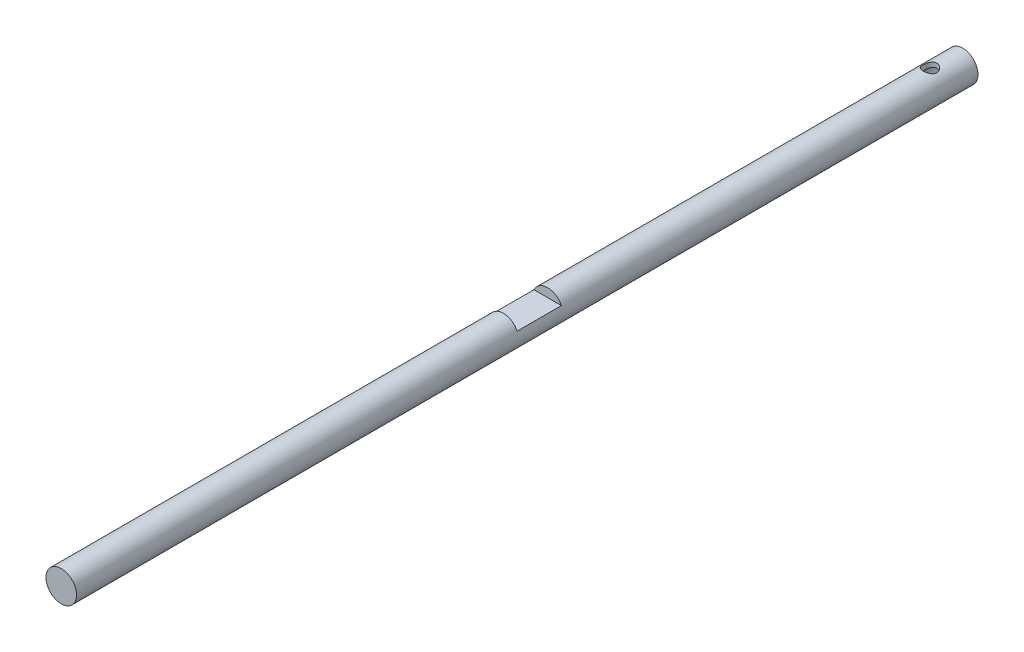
ISO-10303-21;
HEADER;
FILE_DESCRIPTION(('STEP AP214'),'2;1');
FILE_NAME('part.step','',(''),(''),'','','');
FILE_SCHEMA(('AUTOMOTIVE_DESIGN { 1 0 10303 214 1 1 1 1 }'));
ENDSEC;
DATA;
#1=APPLICATION_CONTEXT('core data for automotive mechanical design processes');
#2=APPLICATION_PROTOCOL_DEFINITION('international standard','automotive_design',2000,#1);
#3=PRODUCT_CONTEXT('',#1,'mechanical');
#4=PRODUCT('Part','Part','',(#3));
#5=PRODUCT_RELATED_PRODUCT_CATEGORY('part','',(#4));
#6=PRODUCT_DEFINITION_FORMATION('','',#4);
#7=PRODUCT_DEFINITION_CONTEXT('part definition',#1,'design');
#8=PRODUCT_DEFINITION('design','',#6,#7);
#9=PRODUCT_DEFINITION_SHAPE('','',#8);
#10=(LENGTH_UNIT() NAMED_UNIT(*) SI_UNIT(.MILLI.,.METRE.));
#11=(NAMED_UNIT(*) PLANE_ANGLE_UNIT() SI_UNIT($,.RADIAN.));
#12=(NAMED_UNIT(*) SI_UNIT($,.STERADIAN.) SOLID_ANGLE_UNIT());
#13=UNCERTAINTY_MEASURE_WITH_UNIT(LENGTH_MEASURE(1.E-05),#10,'distance_accuracy_value','');
#14=(GEOMETRIC_REPRESENTATION_CONTEXT(3) GLOBAL_UNCERTAINTY_ASSIGNED_CONTEXT((#13)) GLOBAL_UNIT_ASSIGNED_CONTEXT((#10,
#11,#12)) REPRESENTATION_CONTEXT('',''));
#15=CARTESIAN_POINT('',(0.,0.,0.));
#16=DIRECTION('',(0.,0.,1.));
#17=DIRECTION('',(1.,0.,0.));
#18=AXIS2_PLACEMENT_3D('',#15,#16,#17);
#19=CARTESIAN_POINT('',(0.,0.,-274.6213585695));
#20=DIRECTION('',(0.,0.,1.));
#21=DIRECTION('',(1.,0.,0.));
#22=AXIS2_PLACEMENT_3D('',#19,#20,#21);
#23=CYLINDRICAL_SURFACE('',#22,4.445);
#24=CARTESIAN_POINT('',(-1.29240188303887E-11,4.445,-250.524));
#25=CARTESIAN_POINT('',(0.106363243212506,4.44499571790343,-250.524005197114));
#26=CARTESIAN_POINT('',(0.212889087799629,4.44113977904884,-250.532534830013));
#27=CARTESIAN_POINT('',(0.422868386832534,4.42609838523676,-250.566311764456));
#28=CARTESIAN_POINT('',(0.526313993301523,4.41489564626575,-250.591598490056));
#29=CARTESIAN_POINT('',(0.726763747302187,4.38634837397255,-250.657744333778));
#30=CARTESIAN_POINT('',(0.823789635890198,4.36902597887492,-250.698547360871));
#31=CARTESIAN_POINT('',(1.00950916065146,4.32988863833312,-250.794313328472));
#32=CARTESIAN_POINT('',(1.09820456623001,4.30807465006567,-250.849273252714));
#33=CARTESIAN_POINT('',(1.26991974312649,4.2607121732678,-250.975061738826));
#34=CARTESIAN_POINT('',(1.35240803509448,4.23502882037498,-251.046564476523));
#35=CARTESIAN_POINT('',(1.50469291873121,4.18334834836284,-251.201975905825));
#36=CARTESIAN_POINT('',(1.57448175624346,4.15735104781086,-251.285892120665));
#37=CARTESIAN_POINT('',(1.70351755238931,4.10623396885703,-251.469781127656));
#38=CARTESIAN_POINT('',(1.76188954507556,4.0812585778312,-251.570412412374));
#39=CARTESIAN_POINT('',(1.86064265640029,4.03719942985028,-251.781338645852));
#40=CARTESIAN_POINT('',(1.90103452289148,4.01811215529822,-251.891627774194));
#41=CARTESIAN_POINT('',(1.96039734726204,3.98947460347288,-252.112636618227));
#42=CARTESIAN_POINT('',(1.9803977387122,3.97946915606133,-252.22301831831));
#43=CARTESIAN_POINT('',(2.00160733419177,3.96884736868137,-252.445988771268));
#44=CARTESIAN_POINT('',(2.00282957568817,3.96822451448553,-252.55857593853));
#45=CARTESIAN_POINT('',(1.98721453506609,3.97605978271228,-252.771649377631));
#46=CARTESIAN_POINT('',(1.97203221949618,3.98368579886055,-252.872294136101));
#47=CARTESIAN_POINT('',(1.92684978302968,4.00573340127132,-253.069416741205));
#48=CARTESIAN_POINT('',(1.89684622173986,4.02015656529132,-253.165893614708));
#49=CARTESIAN_POINT('',(1.82227892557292,4.05450803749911,-253.354557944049));
#50=CARTESIAN_POINT('',(1.7774010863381,4.07455353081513,-253.446598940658));
#51=CARTESIAN_POINT('',(1.6745860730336,4.1178749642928,-253.622238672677));
#52=CARTESIAN_POINT('',(1.61664334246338,4.14115227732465,-253.705833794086));
#53=CARTESIAN_POINT('',(1.48255143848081,4.19114250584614,-253.871018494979));
#54=CARTESIAN_POINT('',(1.40516034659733,4.21796607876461,-253.951569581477));
#55=CARTESIAN_POINT('',(1.23775261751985,4.27009088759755,-254.098931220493));
#56=CARTESIAN_POINT('',(1.14773198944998,4.29539163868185,-254.165737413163));
#57=CARTESIAN_POINT('',(0.954015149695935,4.34259234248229,-254.285594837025));
#58=CARTESIAN_POINT('',(0.849981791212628,4.36436273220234,-254.338156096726));
#59=CARTESIAN_POINT('',(0.633318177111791,4.40101924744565,-254.424654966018));
#60=CARTESIAN_POINT('',(0.520693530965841,4.41590982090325,-254.458604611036));
#61=CARTESIAN_POINT('',(0.298662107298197,4.4362550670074,-254.504587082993));
#62=CARTESIAN_POINT('',(0.189597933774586,4.44230652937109,-254.518009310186));
#63=CARTESIAN_POINT('',(-0.029386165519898,4.44624972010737,-254.526780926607));
#64=CARTESIAN_POINT('',(-0.139305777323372,4.44414431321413,-254.522136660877));
#65=CARTESIAN_POINT('',(-0.349923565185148,4.4323862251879,-254.495837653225));
#66=CARTESIAN_POINT('',(-0.450779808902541,4.42319298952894,-254.475218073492));
#67=CARTESIAN_POINT('',(-0.647455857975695,4.39871034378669,-254.419063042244));
#68=CARTESIAN_POINT('',(-0.743275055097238,4.38342019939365,-254.383525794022));
#69=CARTESIAN_POINT('',(-0.930548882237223,4.34758331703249,-254.297423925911));
#70=CARTESIAN_POINT('',(-1.02177490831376,4.32688780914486,-254.246426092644));
#71=CARTESIAN_POINT('',(-1.19470268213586,4.28237041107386,-254.131322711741));
#72=CARTESIAN_POINT('',(-1.27640023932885,4.25854715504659,-254.067211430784));
#73=CARTESIAN_POINT('',(-1.43505320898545,4.20786670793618,-253.921552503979));
#74=CARTESIAN_POINT('',(-1.51106326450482,4.18092126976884,-253.839003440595));
#75=CARTESIAN_POINT('',(-1.64848022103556,4.12867468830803,-253.662012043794));
#76=CARTESIAN_POINT('',(-1.70988152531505,4.10337417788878,-253.567565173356));
#77=CARTESIAN_POINT('',(-1.81769607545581,4.05679120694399,-253.366224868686));
#78=CARTESIAN_POINT('',(-1.8636859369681,4.03562802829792,-253.259074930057));
#79=CARTESIAN_POINT('',(-1.93652362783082,4.00119393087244,-253.037286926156));
#80=CARTESIAN_POINT('',(-1.96339079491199,3.98791504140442,-252.922656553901));
#81=CARTESIAN_POINT('',(-1.99515796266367,3.97210973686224,-252.699794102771));
#82=CARTESIAN_POINT('',(-2.00175148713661,3.96875532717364,-252.591861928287));
#83=CARTESIAN_POINT('',(-1.99745465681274,3.97092037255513,-252.376449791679));
#84=CARTESIAN_POINT('',(-1.98656828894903,3.97643780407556,-252.268969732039));
#85=CARTESIAN_POINT('',(-1.94911453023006,3.99491749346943,-252.064576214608));
#86=CARTESIAN_POINT('',(-1.92358091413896,4.00738755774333,-251.967424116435));
#87=CARTESIAN_POINT('',(-1.85866533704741,4.03790381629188,-251.778802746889));
#88=CARTESIAN_POINT('',(-1.81927934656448,4.05595163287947,-251.687335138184));
#89=CARTESIAN_POINT('',(-1.72486611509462,4.0970320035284,-251.506190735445));
#90=CARTESIAN_POINT('',(-1.66899166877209,4.1203115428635,-251.417012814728));
#91=CARTESIAN_POINT('',(-1.54427139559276,4.16865947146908,-251.248773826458));
#92=CARTESIAN_POINT('',(-1.475419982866,4.19372862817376,-251.169717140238));
#93=CARTESIAN_POINT('',(-1.31933427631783,4.24555437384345,-251.016563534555));
#94=CARTESIAN_POINT('',(-1.23099984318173,4.27225816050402,-250.94356426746));
#95=CARTESIAN_POINT('',(-1.04241244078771,4.32214097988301,-250.813296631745));
#96=CARTESIAN_POINT('',(-0.94215402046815,4.34531838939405,-250.756035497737));
#97=CARTESIAN_POINT('',(-0.733291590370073,4.38537363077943,-250.659763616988));
#98=CARTESIAN_POINT('',(-0.624780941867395,4.40231207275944,-250.620576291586));
#99=CARTESIAN_POINT('',(-0.401922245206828,4.42820212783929,-250.561433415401));
#100=CARTESIAN_POINT('',(-0.287593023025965,4.43717795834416,-250.541419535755));
#101=CARTESIAN_POINT('',(-0.143767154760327,4.44276840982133,-250.528964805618));
#102=CARTESIAN_POINT('',(-0.115055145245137,4.44360376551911,-250.527104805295));
#103=CARTESIAN_POINT('',(-0.0575660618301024,4.4447201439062,-250.524621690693));
#104=CARTESIAN_POINT('',(-0.0287889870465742,4.44500115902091,-250.523998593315));
#105=CARTESIAN_POINT('',(-1.29240188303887E-11,4.445,-250.524));
#106=B_SPLINE_CURVE_WITH_KNOTS('',3,(#24,#25,#26,#27,#28,#29,#30,#31,#32,#33,#34,#35,#36,#37,
#38,#39,#40,#41,#42,#43,#44,#45,#46,#47,#48,#49,#50,#51,#52,#53,#54,#55,#56,#57,#58,#59,#60,#61,
#62,#63,#64,#65,#66,#67,#68,#69,#70,#71,#72,#73,#74,#75,#76,#77,#78,#79,#80,#81,#82,#83,#84,#85,
#86,#87,#88,#89,#90,#91,#92,#93,#94,#95,#96,#97,#98,#99,#100,#101,#102,#103,#104,#105),
.UNSPECIFIED.,.T.,.F.,(4,2,2,2,2,2,2,2,2,2,2,2,2,2,2,2,2,2,2,2,2,2,2,2,2,2,2,2,2,2,2,2,2,2,2,2,
2,2,2,2,4),(0.,0.318971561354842,0.63869623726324,0.957275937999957,1.27578781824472,
1.61078769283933,1.94599143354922,2.30115143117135,2.65609884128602,2.99207676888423,
3.32782142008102,3.63260535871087,3.937460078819,4.24921303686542,4.56109883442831,
4.90420630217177,5.24742243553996,5.60126612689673,5.95488073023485,6.28329668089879,
6.61159730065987,6.92024073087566,7.22892134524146,7.54720756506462,7.86563324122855,
8.21029539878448,8.55508938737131,8.90869964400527,9.26195180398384,9.58476200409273,
9.90749858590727,10.2098523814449,10.5122942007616,10.8343065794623,11.1564578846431,
11.5077856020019,11.8592745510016,12.2072527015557,12.5541688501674,12.6405026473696,
12.726837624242),.UNSPECIFIED.);
#107=CARTESIAN_POINT('',(-1.29240188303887E-11,4.445,-250.524));
#108=VERTEX_POINT('',#107);
#109=EDGE_CURVE('E87',#108,#108,#106,.T.);
#110=ORIENTED_EDGE('',*,*,#109,.F.);
#111=EDGE_LOOP('',(#110));
#112=FACE_BOUND('',#111,.T.);
#113=DIRECTION('',(0.,0.,1.));
#114=VECTOR('',#113,1.);
#115=CARTESIAN_POINT('',(3.99443675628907,1.95000000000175,-274.6213585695));
#116=LINE('',#115,#114);
#117=CARTESIAN_POINT('',(3.99443675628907,1.95000000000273,-128.524));
#118=VERTEX_POINT('',#117);
#119=CARTESIAN_POINT('',(3.99443675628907,1.95000000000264,-141.399000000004));
#120=VERTEX_POINT('',#119);
#121=EDGE_CURVE('E11',#118,#120,#116,.F.);
#122=ORIENTED_EDGE('',*,*,#121,.F.);
#123=CARTESIAN_POINT('',(0.,0.,-128.524));
#124=DIRECTION('',(0.,0.,1.));
#125=DIRECTION('',(1.,0.,0.));
#126=AXIS2_PLACEMENT_3D('',#123,#124,#125);
#127=CIRCLE('',#126,4.445);
#128=CARTESIAN_POINT('',(-3.99443675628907,1.95000000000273,-128.524));
#129=VERTEX_POINT('',#128);
#130=EDGE_CURVE('E47',#129,#118,#127,.F.);
#131=ORIENTED_EDGE('',*,*,#130,.F.);
#132=DIRECTION('',(0.,0.,1.));
#133=VECTOR('',#132,1.);
#134=CARTESIAN_POINT('',(-3.99443675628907,1.95000000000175,-274.6213585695));
#135=LINE('',#134,#133);
#136=CARTESIAN_POINT('',(-3.99443675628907,1.95000000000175,-141.399000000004));
#137=VERTEX_POINT('',#136);
#138=EDGE_CURVE('E63',#137,#129,#135,.T.);
#139=ORIENTED_EDGE('',*,*,#138,.F.);
#140=CARTESIAN_POINT('',(0.,0.,-141.399000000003));
#141=DIRECTION('',(0.,0.,1.));
#142=DIRECTION('',(1.,0.,0.));
#143=AXIS2_PLACEMENT_3D('',#140,#141,#142);
#144=CIRCLE('',#143,4.445);
#145=EDGE_CURVE('E70',#137,#120,#144,.F.);
#146=ORIENTED_EDGE('',*,*,#145,.T.);
#147=EDGE_LOOP('',(#122,#131,#139,#146));
#148=FACE_BOUND('',#147,.T.);
#149=CARTESIAN_POINT('',(0.,0.,-262.049000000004));
#150=DIRECTION('',(0.,0.,1.));
#151=DIRECTION('',(1.,0.,0.));
#152=AXIS2_PLACEMENT_3D('',#149,#150,#151);
#153=CIRCLE('',#152,4.445);
#154=CARTESIAN_POINT('',(4.445,0.,-262.049000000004));
#155=VERTEX_POINT('',#154);
#156=EDGE_CURVE('E71',#155,#155,#153,.F.);
#157=ORIENTED_EDGE('',*,*,#156,.F.);
#158=EDGE_LOOP('',(#157));
#159=FACE_BOUND('',#158,.T.);
#160=CARTESIAN_POINT('',(0.,0.,0.));
#161=DIRECTION('',(0.,0.,1.));
#162=DIRECTION('',(1.,0.,0.));
#163=AXIS2_PLACEMENT_3D('',#160,#161,#162);
#164=CIRCLE('',#163,4.445);
#165=CARTESIAN_POINT('',(4.445,0.,0.));
#166=VERTEX_POINT('',#165);
#167=EDGE_CURVE('E112',#166,#166,#164,.T.);
#168=ORIENTED_EDGE('',*,*,#167,.F.);
#169=EDGE_LOOP('',(#168));
#170=FACE_BOUND('',#169,.T.);
#171=ADVANCED_FACE('F39',(#112,#148,#159,#170),#23,.T.);
#172=CARTESIAN_POINT('',(0.,0.,0.));
#173=DIRECTION('',(0.,0.,1.));
#174=DIRECTION('',(1.,0.,0.));
#175=AXIS2_PLACEMENT_3D('',#172,#173,#174);
#176=PLANE('',#175);
#177=ORIENTED_EDGE('',*,*,#167,.T.);
#178=EDGE_LOOP('',(#177));
#179=FACE_BOUND('',#178,.T.);
#180=ADVANCED_FACE('F123',(#179),#176,.T.);
#181=CARTESIAN_POINT('',(-2.24999999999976,5.3776427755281E-13,-262.049000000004));
#182=DIRECTION('',(0.,0.,1.));
#183=DIRECTION('',(-1.,0.,0.));
#184=AXIS2_PLACEMENT_3D('',#181,#182,#183);
#185=PLANE('',#184);
#186=CARTESIAN_POINT('',(9.21358755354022E-13,-2.49844115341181E-13,-262.049000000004));
#187=DIRECTION('',(0.,0.,-1.));
#188=DIRECTION('',(-1.,0.,0.));
#189=AXIS2_PLACEMENT_3D('',#186,#187,#188);
#190=CIRCLE('',#189,3.17499999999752);
#191=CARTESIAN_POINT('',(-3.17499999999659,-2.49844115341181E-13,-262.049000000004));
#192=VERTEX_POINT('',#191);
#193=EDGE_CURVE('E107',#192,#192,#190,.T.);
#194=ORIENTED_EDGE('',*,*,#193,.F.);
#195=EDGE_LOOP('',(#194));
#196=FACE_BOUND('',#195,.T.);
#197=ORIENTED_EDGE('',*,*,#156,.T.);
#198=EDGE_LOOP('',(#197));
#199=FACE_BOUND('',#198,.T.);
#200=ADVANCED_FACE('F120',(#196,#199),#185,.F.);
#201=CARTESIAN_POINT('',(8.32052891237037E-13,-2.25627115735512E-13,-236.649000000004));
#202=DIRECTION('',(0.,0.,-1.));
#203=DIRECTION('',(-1.,0.,0.));
#204=AXIS2_PLACEMENT_3D('',#201,#202,#203);
#205=CYLINDRICAL_SURFACE('',#204,3.17499999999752);
#206=CARTESIAN_POINT('',(-1.29243008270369E-11,3.17499999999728,-250.524));
#207=CARTESIAN_POINT('',(0.101476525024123,3.17499226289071,-250.524008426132));
#208=CARTESIAN_POINT('',(0.203070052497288,3.17008417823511,-250.531775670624));
#209=CARTESIAN_POINT('',(0.403126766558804,3.15091460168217,-250.562425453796));
#210=CARTESIAN_POINT('',(0.501584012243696,3.13663635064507,-250.58533507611));
#211=CARTESIAN_POINT('',(0.692090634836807,3.10016098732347,-250.644924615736));
#212=CARTESIAN_POINT('',(0.784169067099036,3.07800305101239,-250.681536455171));
#213=CARTESIAN_POINT('',(0.960549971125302,3.02760547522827,-250.767025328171));
#214=CARTESIAN_POINT('',(1.04485310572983,2.99936635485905,-250.815901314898));
#215=CARTESIAN_POINT('',(1.21096397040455,2.93644329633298,-250.928865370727));
#216=CARTESIAN_POINT('',(1.29202459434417,2.90142355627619,-250.993861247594));
#217=CARTESIAN_POINT('',(1.4428178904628,2.82946962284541,-251.135125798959));
#218=CARTESIAN_POINT('',(1.51253493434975,2.79253287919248,-251.211409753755));
#219=CARTESIAN_POINT('',(1.64846069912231,2.71479906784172,-251.385404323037));
#220=CARTESIAN_POINT('',(1.71285716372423,2.6741728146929,-251.484619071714));
#221=CARTESIAN_POINT('',(1.82388334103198,2.59972200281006,-251.694834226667));
#222=CARTESIAN_POINT('',(1.87054322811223,2.5658859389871,-251.805814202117));
#223=CARTESIAN_POINT('',(1.93404005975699,2.51818564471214,-252.006806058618));
#224=CARTESIAN_POINT('',(1.95549189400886,2.50140969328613,-252.094664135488));
#225=CARTESIAN_POINT('',(1.98634051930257,2.47698936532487,-252.273661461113));
#226=CARTESIAN_POINT('',(1.99575475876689,2.46933177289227,-252.364795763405));
#227=CARTESIAN_POINT('',(2.00196100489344,2.46430468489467,-252.548042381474));
#228=CARTESIAN_POINT('',(1.99871804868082,2.466963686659,-252.64015670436));
#229=CARTESIAN_POINT('',(1.97975435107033,2.48220365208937,-252.8222795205));
#230=CARTESIAN_POINT('',(1.96402350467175,2.49479265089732,-252.912286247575));
#231=CARTESIAN_POINT('',(1.92154408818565,2.52764357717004,-253.085644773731));
#232=CARTESIAN_POINT('',(1.89508126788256,2.54770547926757,-253.169106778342));
#233=CARTESIAN_POINT('',(1.832201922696,2.59329248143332,-253.330568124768));
#234=CARTESIAN_POINT('',(1.79578189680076,2.6188195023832,-253.40856553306));
#235=CARTESIAN_POINT('',(1.70611370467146,2.67828449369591,-253.572563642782));
#236=CARTESIAN_POINT('',(1.65098588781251,2.71290024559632,-253.657290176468));
#237=CARTESIAN_POINT('',(1.52895400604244,2.7835060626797,-253.817226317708));
#238=CARTESIAN_POINT('',(1.46203770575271,2.81949752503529,-253.892425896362));
#239=CARTESIAN_POINT('',(1.30487665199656,2.89599631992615,-254.044254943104));
#240=CARTESIAN_POINT('',(1.21259971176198,2.93622794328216,-254.118944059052));
#241=CARTESIAN_POINT('',(1.01448876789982,3.01041623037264,-254.251717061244));
#242=CARTESIAN_POINT('',(0.908659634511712,3.04437513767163,-254.309806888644));
#243=CARTESIAN_POINT('',(0.691622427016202,3.10067441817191,-254.404136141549));
#244=CARTESIAN_POINT('',(0.580977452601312,3.12352576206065,-254.441352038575));
#245=CARTESIAN_POINT('',(0.353219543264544,3.15737991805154,-254.496027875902));
#246=CARTESIAN_POINT('',(0.236116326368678,3.16840004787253,-254.513516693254));
#247=CARTESIAN_POINT('',(0.0180413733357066,3.17653556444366,-254.526439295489));
#248=CARTESIAN_POINT('',(-0.0826993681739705,3.17549752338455,-254.524801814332));
#249=CARTESIAN_POINT('',(-0.282251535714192,3.16400646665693,-254.506514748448));
#250=CARTESIAN_POINT('',(-0.381063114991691,3.15355420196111,-254.48986636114));
#251=CARTESIAN_POINT('',(-0.569785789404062,3.12485337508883,-254.443478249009));
#252=CARTESIAN_POINT('',(-0.659896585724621,3.10695351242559,-254.414322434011));
#253=CARTESIAN_POINT('',(-0.833839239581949,3.064857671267,-254.344304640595));
#254=CARTESIAN_POINT('',(-0.917670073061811,3.04066066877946,-254.303440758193));
#255=CARTESIAN_POINT('',(-1.08579010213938,2.98501096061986,-254.206673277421));
#256=CARTESIAN_POINT('',(-1.16928557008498,2.95307446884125,-254.149673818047));
#257=CARTESIAN_POINT('',(-1.32610017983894,2.88606502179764,-254.024513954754));
#258=CARTESIAN_POINT('',(-1.39940803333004,2.85098865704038,-253.95634134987));
#259=CARTESIAN_POINT('',(-1.54501953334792,2.77510866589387,-253.799160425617));
#260=CARTESIAN_POINT('',(-1.61557264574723,2.73422493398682,-253.708561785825));
#261=CARTESIAN_POINT('',(-1.74075576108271,2.65628150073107,-253.515457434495));
#262=CARTESIAN_POINT('',(-1.79539548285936,2.61921947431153,-253.412959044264));
#263=CARTESIAN_POINT('',(-1.87731719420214,2.56091666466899,-253.219898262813));
#264=CARTESIAN_POINT('',(-1.90792193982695,2.53798885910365,-253.131263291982));
#265=CARTESIAN_POINT('',(-1.95660261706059,2.5006567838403,-252.948943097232));
#266=CARTESIAN_POINT('',(-1.97469844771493,2.48623898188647,-252.855266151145));
#267=CARTESIAN_POINT('',(-1.99736898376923,2.4680703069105,-252.66462420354));
#268=CARTESIAN_POINT('',(-2.00186040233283,2.46438514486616,-252.567642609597));
#269=CARTESIAN_POINT('',(-1.99673295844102,2.46854006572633,-252.374286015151));
#270=CARTESIAN_POINT('',(-1.98711028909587,2.47638325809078,-252.277911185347));
#271=CARTESIAN_POINT('',(-1.95590161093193,2.50108241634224,-252.097241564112));
#272=CARTESIAN_POINT('',(-1.9354349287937,2.51709058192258,-252.012627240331));
#273=CARTESIAN_POINT('',(-1.88430589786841,2.55558918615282,-251.848115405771));
#274=CARTESIAN_POINT('',(-1.85363913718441,2.57808242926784,-251.768219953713));
#275=CARTESIAN_POINT('',(-1.7780295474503,2.63090189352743,-251.60313797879));
#276=CARTESIAN_POINT('',(-1.73167768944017,2.6618868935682,-251.518811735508));
#277=CARTESIAN_POINT('',(-1.6279871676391,2.72654071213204,-251.358323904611));
#278=CARTESIAN_POINT('',(-1.57063977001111,2.76021165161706,-251.282168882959));
#279=CARTESIAN_POINT('',(-1.43290771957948,2.83455450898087,-251.124036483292));
#280=CARTESIAN_POINT('',(-1.35021039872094,2.87524740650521,-251.044062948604));
#281=CARTESIAN_POINT('',(-1.17116070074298,2.95271860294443,-250.898669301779));
#282=CARTESIAN_POINT('',(-1.0747991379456,2.98949423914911,-250.833259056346));
#283=CARTESIAN_POINT('',(-0.869021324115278,3.05567422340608,-250.718805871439));
#284=CARTESIAN_POINT('',(-0.759495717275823,3.08500948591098,-250.669915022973));
#285=CARTESIAN_POINT('',(-0.588629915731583,3.12050401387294,-250.611633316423));
#286=CARTESIAN_POINT('',(-0.530633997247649,3.13091186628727,-250.594723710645));
#287=CARTESIAN_POINT('',(-0.412912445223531,3.14859608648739,-250.566153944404));
#288=CARTESIAN_POINT('',(-0.35318808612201,3.15587470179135,-250.55449001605));
#289=CARTESIAN_POINT('',(-0.244573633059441,3.16593862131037,-250.538408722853));
#290=CARTESIAN_POINT('',(-0.19588156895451,3.16932847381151,-250.53301344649));
#291=CARTESIAN_POINT('',(-0.0981354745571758,3.17386110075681,-250.525806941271));
#292=CARTESIAN_POINT('',(-0.0490814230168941,3.17500374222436,-250.523995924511));
#293=CARTESIAN_POINT('',(-1.29243008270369E-11,3.17499999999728,-250.524));
#294=B_SPLINE_CURVE_WITH_KNOTS('',3,(#206,#207,#208,#209,#210,#211,#212,#213,#214,#215,#216,
#217,#218,#219,#220,#221,#222,#223,#224,#225,#226,#227,#228,#229,#230,#231,#232,#233,#234,#235,
#236,#237,#238,#239,#240,#241,#242,#243,#244,#245,#246,#247,#248,#249,#250,#251,#252,#253,#254,
#255,#256,#257,#258,#259,#260,#261,#262,#263,#264,#265,#266,#267,#268,#269,#270,#271,#272,#273,
#274,#275,#276,#277,#278,#279,#280,#281,#282,#283,#284,#285,#286,#287,#288,#289,#290,#291,#292,
#293),.UNSPECIFIED.,.T.,.F.,(4,2,2,2,2,2,2,2,2,2,2,2,2,2,2,2,2,2,2,2,2,2,2,2,2,2,2,2,2,2,2,2,2,
2,2,2,2,2,2,2,2,2,2,4),(0.,0.304232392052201,0.609010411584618,0.912293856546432,
1.21555142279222,1.54321972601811,1.87133571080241,2.24473770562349,2.61750157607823,
2.89230792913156,3.16671549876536,3.44188159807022,3.71727058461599,3.98576376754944,
4.25435147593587,4.57371032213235,4.89340260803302,5.26757704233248,5.64161738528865,
5.99627086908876,6.35040452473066,6.65112338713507,6.95181826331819,7.2397863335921,
7.52780126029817,7.84463984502,8.16182674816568,8.52590386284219,8.88975815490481,
9.17822046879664,9.46622283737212,9.75598484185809,10.0458250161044,10.3103283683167,
10.5749462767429,10.8771490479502,11.1795928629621,11.5440020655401,11.9086574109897,
12.2765839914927,12.4602144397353,12.6437127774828,12.7908529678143,12.9380018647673),.UNSPECIFIED.);
#295=CARTESIAN_POINT('',(-1.29243008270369E-11,3.17499999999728,-250.524));
#296=VERTEX_POINT('',#295);
#297=EDGE_CURVE('E75',#296,#296,#294,.T.);
#298=ORIENTED_EDGE('',*,*,#297,.T.);
#299=EDGE_LOOP('',(#298));
#300=FACE_BOUND('',#299,.T.);
#301=CARTESIAN_POINT('',(8.32052891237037E-13,-2.25627115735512E-13,-236.649000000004));
#302=DIRECTION('',(0.,0.,-1.));
#303=DIRECTION('',(-1.,0.,0.));
#304=AXIS2_PLACEMENT_3D('',#301,#302,#303);
#305=CIRCLE('',#304,3.17499999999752);
#306=CARTESIAN_POINT('',(-3.17499999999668,-2.25627115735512E-13,-236.649000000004));
#307=VERTEX_POINT('',#306);
#308=EDGE_CURVE('E109',#307,#307,#305,.T.);
#309=ORIENTED_EDGE('',*,*,#308,.F.);
#310=EDGE_LOOP('',(#309));
#311=FACE_BOUND('',#310,.T.);
#312=ORIENTED_EDGE('',*,*,#193,.T.);
#313=EDGE_LOOP('',(#312));
#314=FACE_BOUND('',#313,.T.);
#315=ADVANCED_FACE('F89',(#300,#311,#314),#205,.F.);
#316=CARTESIAN_POINT('',(8.32052891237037E-13,-2.25627115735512E-13,-236.649000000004));
#317=DIRECTION('',(0.,0.,-1.));
#318=DIRECTION('',(-1.,0.,0.));
#319=AXIS2_PLACEMENT_3D('',#316,#317,#318);
#320=PLANE('',#319);
#321=ORIENTED_EDGE('',*,*,#308,.T.);
#322=EDGE_LOOP('',(#321));
#323=FACE_BOUND('',#322,.T.);
#324=ADVANCED_FACE('F97',(#323),#320,.T.);
#325=CARTESIAN_POINT('',(-1.2924572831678E-11,1.95000000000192,-252.524000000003));
#326=DIRECTION('',(0.,1.,0.));
#327=DIRECTION('',(0.,0.,1.));
#328=AXIS2_PLACEMENT_3D('',#325,#326,#327);
#329=CYLINDRICAL_SURFACE('',#328,2.0000000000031);
#330=ORIENTED_EDGE('',*,*,#109,.T.);
#331=EDGE_LOOP('',(#330));
#332=FACE_BOUND('',#331,.T.);
#333=ORIENTED_EDGE('',*,*,#297,.F.);
#334=EDGE_LOOP('',(#333));
#335=FACE_BOUND('',#334,.T.);
#336=ADVANCED_FACE('F93',(#332,#335),#329,.F.);
#337=CARTESIAN_POINT('',(-4.44499999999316,1.95000000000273,-128.524));
#338=DIRECTION('',(0.,0.,1.));
#339=DIRECTION('',(1.,0.,0.));
#340=AXIS2_PLACEMENT_3D('',#337,#338,#339);
#341=PLANE('',#340);
#342=ORIENTED_EDGE('',*,*,#130,.T.);
#343=DIRECTION('',(1.,0.,0.));
#344=VECTOR('',#343,1.);
#345=CARTESIAN_POINT('',(-4.44499999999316,1.95000000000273,-128.524));
#346=LINE('',#345,#344);
#347=EDGE_CURVE('E66',#129,#118,#346,.T.);
#348=ORIENTED_EDGE('',*,*,#347,.F.);
#349=EDGE_LOOP('',(#342,#348));
#350=FACE_BOUND('',#349,.T.);
#351=ADVANCED_FACE('F74',(#350),#341,.F.);
#352=CARTESIAN_POINT('',(-4.44499999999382,1.95000000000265,-141.399000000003));
#353=DIRECTION('',(0.,0.,1.));
#354=DIRECTION('',(1.,0.,0.));
#355=AXIS2_PLACEMENT_3D('',#352,#353,#354);
#356=PLANE('',#355);
#357=DIRECTION('',(1.,0.,0.));
#358=VECTOR('',#357,1.);
#359=CARTESIAN_POINT('',(-4.44499999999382,1.95000000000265,-141.399000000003));
#360=LINE('',#359,#358);
#361=EDGE_CURVE('E53',#137,#120,#360,.T.);
#362=ORIENTED_EDGE('',*,*,#361,.T.);
#363=ORIENTED_EDGE('',*,*,#145,.F.);
#364=EDGE_LOOP('',(#362,#363));
#365=FACE_BOUND('',#364,.T.);
#366=ADVANCED_FACE('F170',(#365),#356,.T.);
#367=CARTESIAN_POINT('',(0.,1.9500000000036,0.));
#368=DIRECTION('',(0.,-1.,0.));
#369=DIRECTION('',(0.,0.,-1.));
#370=AXIS2_PLACEMENT_3D('',#367,#368,#369);
#371=PLANE('',#370);
#372=ORIENTED_EDGE('',*,*,#121,.T.);
#373=ORIENTED_EDGE('',*,*,#361,.F.);
#374=ORIENTED_EDGE('',*,*,#138,.T.);
#375=ORIENTED_EDGE('',*,*,#347,.T.);
#376=EDGE_LOOP('',(#372,#373,#374,#375));
#377=FACE_BOUND('',#376,.T.);
#378=ADVANCED_FACE('F65',(#377),#371,.F.);
#379=CLOSED_SHELL('',(#171,#180,#200,#315,#324,#336,#351,#366,#378));
#380=MANIFOLD_SOLID_BREP('B2',#379);
#381=ADVANCED_BREP_SHAPE_REPRESENTATION('',(#18,#380),#14);
#382=SHAPE_DEFINITION_REPRESENTATION(#9,#381);
ENDSEC;
END-ISO-10303-21;
